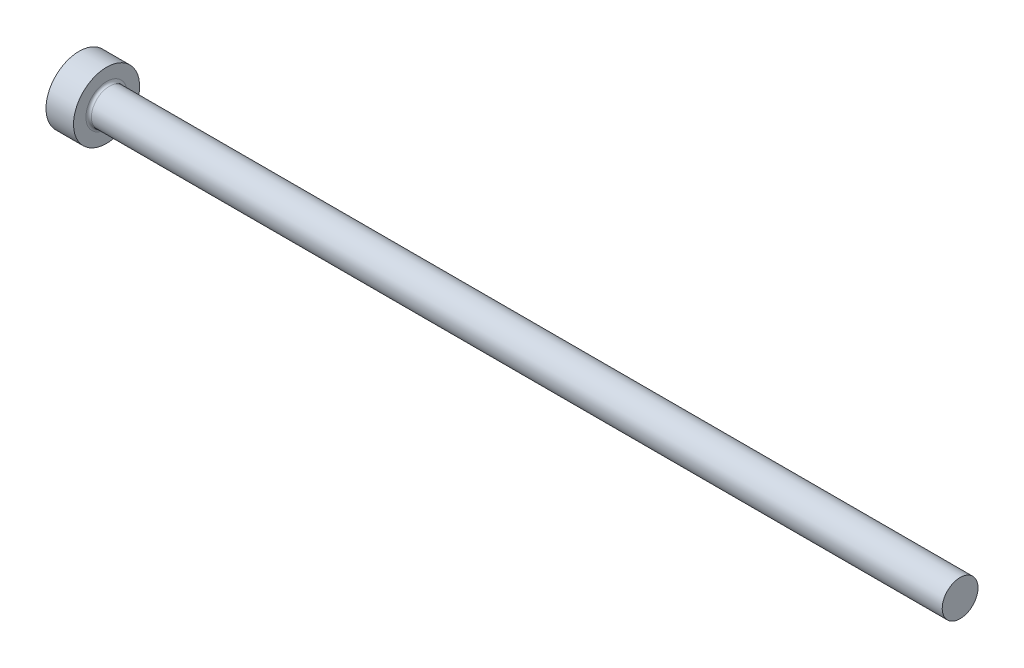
ISO-10303-21;
HEADER;
FILE_DESCRIPTION(('STEP AP214'),'2;1');
FILE_NAME('part.step','',(''),(''),'','','');
FILE_SCHEMA(('AUTOMOTIVE_DESIGN { 1 0 10303 214 1 1 1 1 }'));
ENDSEC;
DATA;
#1=APPLICATION_CONTEXT('core data for automotive mechanical design processes');
#2=APPLICATION_PROTOCOL_DEFINITION('international standard','automotive_design',2000,#1);
#3=PRODUCT_CONTEXT('',#1,'mechanical');
#4=PRODUCT('Part','Part','',(#3));
#5=PRODUCT_RELATED_PRODUCT_CATEGORY('part','',(#4));
#6=PRODUCT_DEFINITION_FORMATION('','',#4);
#7=PRODUCT_DEFINITION_CONTEXT('part definition',#1,'design');
#8=PRODUCT_DEFINITION('design','',#6,#7);
#9=PRODUCT_DEFINITION_SHAPE('','',#8);
#10=(LENGTH_UNIT() NAMED_UNIT(*) SI_UNIT(.MILLI.,.METRE.));
#11=(NAMED_UNIT(*) PLANE_ANGLE_UNIT() SI_UNIT($,.RADIAN.));
#12=(NAMED_UNIT(*) SI_UNIT($,.STERADIAN.) SOLID_ANGLE_UNIT());
#13=UNCERTAINTY_MEASURE_WITH_UNIT(LENGTH_MEASURE(1.E-05),#10,'distance_accuracy_value','');
#14=(GEOMETRIC_REPRESENTATION_CONTEXT(3) GLOBAL_UNCERTAINTY_ASSIGNED_CONTEXT((#13)) GLOBAL_UNIT_ASSIGNED_CONTEXT((#10,
#11,#12)) REPRESENTATION_CONTEXT('',''));
#15=CARTESIAN_POINT('',(0.,0.,0.));
#16=DIRECTION('',(0.,0.,1.));
#17=DIRECTION('',(1.,0.,0.));
#18=AXIS2_PLACEMENT_3D('',#15,#16,#17);
#19=CARTESIAN_POINT('',(0.,0.,0.));
#20=DIRECTION('',(-1.,0.,0.));
#21=DIRECTION('',(0.,-1.,0.));
#22=AXIS2_PLACEMENT_3D('',#19,#20,#21);
#23=PLANE('',#22);
#24=CARTESIAN_POINT('',(0.,0.,0.));
#25=DIRECTION('',(1.,0.,0.));
#26=DIRECTION('',(0.,1.,0.));
#27=AXIS2_PLACEMENT_3D('',#24,#25,#26);
#28=CIRCLE('',#27,6.);
#29=CARTESIAN_POINT('',(0.,6.,0.));
#30=VERTEX_POINT('',#29);
#31=EDGE_CURVE('E25',#30,#30,#28,.T.);
#32=ORIENTED_EDGE('',*,*,#31,.F.);
#33=EDGE_LOOP('',(#32));
#34=FACE_BOUND('',#33,.T.);
#35=ADVANCED_FACE('F14',(#34),#23,.T.);
#36=CARTESIAN_POINT('',(160.,0.,0.));
#37=DIRECTION('',(1.,0.,0.));
#38=DIRECTION('',(0.,1.,0.));
#39=AXIS2_PLACEMENT_3D('',#36,#37,#38);
#40=CYLINDRICAL_SURFACE('',#39,6.);
#41=ORIENTED_EDGE('',*,*,#31,.T.);
#42=EDGE_LOOP('',(#41));
#43=FACE_BOUND('',#42,.T.);
#44=CARTESIAN_POINT('',(5.,0.,0.));
#45=DIRECTION('',(1.,0.,0.));
#46=DIRECTION('',(0.,1.,0.));
#47=AXIS2_PLACEMENT_3D('',#44,#45,#46);
#48=CIRCLE('',#47,6.);
#49=CARTESIAN_POINT('',(5.,6.,0.));
#50=VERTEX_POINT('',#49);
#51=EDGE_CURVE('E29',#50,#50,#48,.T.);
#52=ORIENTED_EDGE('',*,*,#51,.F.);
#53=EDGE_LOOP('',(#52));
#54=FACE_BOUND('',#53,.T.);
#55=ADVANCED_FACE('F51',(#43,#54),#40,.T.);
#56=CARTESIAN_POINT('',(5.,6.,0.));
#57=DIRECTION('',(1.,0.,0.));
#58=DIRECTION('',(0.,1.,0.));
#59=AXIS2_PLACEMENT_3D('',#56,#57,#58);
#60=PLANE('',#59);
#61=CARTESIAN_POINT('',(5.,0.,0.));
#62=DIRECTION('',(1.,0.,0.));
#63=DIRECTION('',(0.,1.,0.));
#64=AXIS2_PLACEMENT_3D('',#61,#62,#63);
#65=CIRCLE('',#64,3.74999999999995);
#66=CARTESIAN_POINT('',(5.,3.74999999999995,0.));
#67=VERTEX_POINT('',#66);
#68=EDGE_CURVE('E9',#67,#67,#65,.F.);
#69=ORIENTED_EDGE('',*,*,#68,.T.);
#70=EDGE_LOOP('',(#69));
#71=FACE_BOUND('',#70,.T.);
#72=ORIENTED_EDGE('',*,*,#51,.T.);
#73=EDGE_LOOP('',(#72));
#74=FACE_BOUND('',#73,.T.);
#75=ADVANCED_FACE('F42',(#71,#74),#60,.T.);
#76=CARTESIAN_POINT('',(160.,0.,0.));
#77=DIRECTION('',(1.,0.,0.));
#78=DIRECTION('',(0.,1.,0.));
#79=AXIS2_PLACEMENT_3D('',#76,#77,#78);
#80=CYLINDRICAL_SURFACE('',#79,3.24999999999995);
#81=CARTESIAN_POINT('',(5.5,0.,0.));
#82=DIRECTION('',(1.,0.,0.));
#83=DIRECTION('',(0.,1.,0.));
#84=AXIS2_PLACEMENT_3D('',#81,#82,#83);
#85=CIRCLE('',#84,3.24999999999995);
#86=CARTESIAN_POINT('',(5.5,3.24999999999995,0.));
#87=VERTEX_POINT('',#86);
#88=EDGE_CURVE('E21',#87,#87,#85,.T.);
#89=ORIENTED_EDGE('',*,*,#88,.T.);
#90=EDGE_LOOP('',(#89));
#91=FACE_BOUND('',#90,.T.);
#92=CARTESIAN_POINT('',(160.,0.,0.));
#93=DIRECTION('',(1.,0.,0.));
#94=DIRECTION('',(0.,1.,0.));
#95=AXIS2_PLACEMENT_3D('',#92,#93,#94);
#96=CIRCLE('',#95,3.25);
#97=CARTESIAN_POINT('',(160.,3.25,0.));
#98=VERTEX_POINT('',#97);
#99=EDGE_CURVE('E34',#98,#98,#96,.T.);
#100=ORIENTED_EDGE('',*,*,#99,.F.);
#101=EDGE_LOOP('',(#100));
#102=FACE_BOUND('',#101,.T.);
#103=ADVANCED_FACE('F40',(#91,#102),#80,.T.);
#104=CARTESIAN_POINT('',(160.,3.25,0.));
#105=DIRECTION('',(1.,0.,0.));
#106=DIRECTION('',(0.,1.,0.));
#107=AXIS2_PLACEMENT_3D('',#104,#105,#106);
#108=PLANE('',#107);
#109=ORIENTED_EDGE('',*,*,#99,.T.);
#110=EDGE_LOOP('',(#109));
#111=FACE_BOUND('',#110,.T.);
#112=ADVANCED_FACE('F38',(#111),#108,.T.);
#113=CARTESIAN_POINT('',(5.5,0.,0.));
#114=DIRECTION('',(1.,0.,0.));
#115=DIRECTION('',(0.,1.,0.));
#116=AXIS2_PLACEMENT_3D('',#113,#114,#115);
#117=TOROIDAL_SURFACE('',#116,3.74999999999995,0.5);
#118=ORIENTED_EDGE('',*,*,#68,.F.);
#119=EDGE_LOOP('',(#118));
#120=FACE_BOUND('',#119,.T.);
#121=ORIENTED_EDGE('',*,*,#88,.F.);
#122=EDGE_LOOP('',(#121));
#123=FACE_BOUND('',#122,.T.);
#124=ADVANCED_FACE('F16',(#120,#123),#117,.F.);
#125=CLOSED_SHELL('',(#35,#55,#75,#103,#112,#124));
#126=MANIFOLD_SOLID_BREP('B1',#125);
#127=ADVANCED_BREP_SHAPE_REPRESENTATION('',(#18,#126),#14);
#128=SHAPE_DEFINITION_REPRESENTATION(#9,#127);
ENDSEC;
END-ISO-10303-21;
